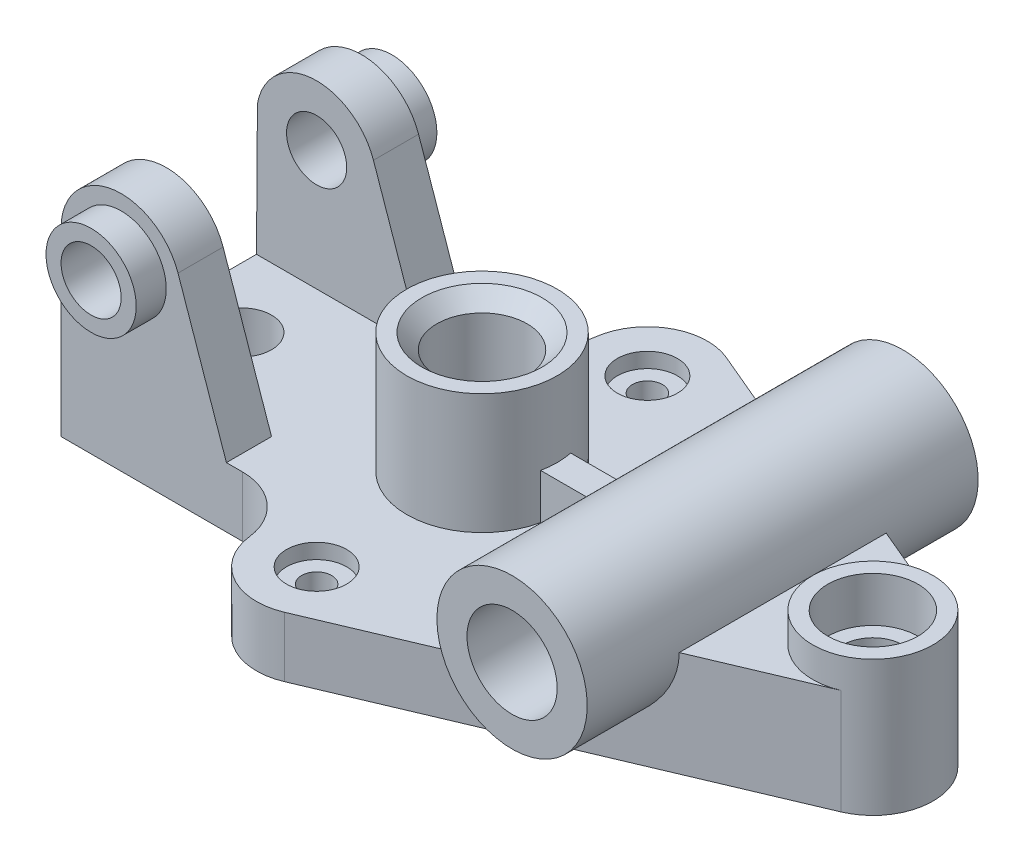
from build123d import *

# Parameters (mm, degrees)
SKETCH4_R                 = 10
BOSS_EXTRUDE1_DEPTH       = 20
SKETCH5_R                 = 10
BOSS_EXTRUDE2_DEPTH       = 15
BOSS_EXTRUDE4_START       = 10
SKETCH6_R                 = 15
SKETCH6_R_2               = 10
BOSS_EXTRUDE4_DEPTH       = 10
BOSS_EXTRUDE6_START       = -15
SKETCH10_R                = 10
BOSS_EXTRUDE6_DEPTH       = 15
SKETCH11_R                = 15
SKETCH11_R_2              = 10
BOSS_EXTRUDE7_DEPTH       = 10
BOSS_EXTRUDE8_DEPTH       = 40
BOSS_EXTRUDE8_DEPTH_BACK  = 35
SKETCH12_R                = 25
SKETCH19_R                = 20
BOSS_EXTRUDE9_DEPTH       = 25
BOSS_EXTRUDE10_DEPTH      = 15
BOSS_EXTRUDE14_DEPTH      = 65
BOSS_EXTRUDE14_DEPTH_BACK = 65
SKETCH28_R                = 25
SKETCH29_R                = 15
CUT_EXTRUDE2_DEPTH        = 181
RIB3_REACH                = 206.59
SKETCH31_WALL_W           = 436.18043746
SKETCH31_WALL_H           = 10
SKETCH34_R                = 5
CUT_EXTRUDE3_DEPTH        = 31
SKETCH35_R                = 10
CUT_EXTRUDE4_DEPTH        = 5


with BuildPart() as part:
    # Sketch4 → Boss-Extrude1 (new body)
    with BuildSketch(Plane(origin=(0, 0, 0), x_dir=(1, 0, 0), z_dir=(0, 1, 0))):
        with BuildLine():
            Line((-77.28011811, -56.673598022), (-77.28011811, 23.326401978))
            Line((-77.28011811, 23.326401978), (-16.966387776, 23.326401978))
            ThreePointArc((-16.966387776, 23.326401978), (-3.737631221, 28.326401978), (2.876747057, 40.826401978))
            ThreePointArc((2.876747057, 40.826401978), (12.736944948, 55.656750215), (30.512681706, 56.745747))
            Line((30.512681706, 56.745747), (160.512681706, 1.745747))
            ThreePointArc((160.512681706, 1.745747), (172.71988189, -16.673598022), (160.512681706, -35.092943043))
            Line((160.512681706, -35.092943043), (30.512681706, -90.092943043))
            ThreePointArc((30.512681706, -90.092943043), (12.736944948, -89.003946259), (2.876747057, -74.173598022))
            ThreePointArc((2.876747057, -74.173598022), (-3.737631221, -61.673598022), (-16.966387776, -56.673598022))
            Line((-16.966387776, -56.673598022), (-77.28011811, -56.673598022))
        make_face()
        with Locations(Location((-57.28011811, -16.673598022, 0), (0, 0, 270))):
            Circle(SKETCH4_R, mode=Mode.SUBTRACT)
    extrude(amount=BOSS_EXTRUDE1_DEPTH)

    # Sketch5 → Boss-Extrude2 (add)
    with BuildSketch(Plane.XY.offset(56.673598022)):
        with BuildLine():
            Line((-77.28011811, 20), (-77.28011811, 60))
            ThreePointArc((-77.28011811, 60), (-60.595178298, 79.723345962), (-38.379080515, 66.538407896))
            Line((-38.379080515, 66.538407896), (-22.28011811, 20))
            Line((-22.28011811, 20), (-77.28011811, 20))
        make_face()
        with Locations((-57.28011811, 60)):
            Circle(SKETCH5_R, mode=Mode.SUBTRACT)
    extrude(amount=-BOSS_EXTRUDE2_DEPTH)

    # Sketch6 → Boss-Extrude4 (add)
    with BuildSketch(Plane.XY.offset(56.673598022).offset(BOSS_EXTRUDE4_START)):
        with Locations(Location((-57.28011811, 60, 0), (0, 0, 180))):
            Circle(SKETCH6_R)
        with Locations((-57.28011811, 60)):
            Circle(SKETCH6_R_2, mode=Mode.SUBTRACT)
    extrude(amount=-BOSS_EXTRUDE4_DEPTH)

    # Sketch10 → Boss-Extrude6 (add)
    with BuildSketch(Plane(origin=(0, 0, -23.326401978), x_dir=(-1, 0, 0), z_dir=(0, 0, -1)).offset(BOSS_EXTRUDE6_START)):
        with BuildLine():
            Line((22.28011811, 20), (38.379080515, 66.538407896))
            ThreePointArc((38.379080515, 66.538407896), (58.842761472, 79.938860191), (76.96898439, 63.514049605))
            Line((76.96898439, 63.514049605), (77.28011811, 20))
            Line((77.28011811, 20), (22.28011811, 20))
        make_face()
        with Locations(Location((57.28011811, 60, 0), (0, 0, 180))):
            Circle(SKETCH10_R, mode=Mode.SUBTRACT)
    extrude(amount=BOSS_EXTRUDE6_DEPTH)

    # Sketch11 → Boss-Extrude7 (add)
    with BuildSketch(Plane(origin=(0, 0, -23.326401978), x_dir=(-1, 0, 0), z_dir=(0, 0, -1))):
        with Locations((57.28011811, 60)):
            Circle(SKETCH11_R)
        with Locations(Location((57.28011811, 60, 0), (0, 0, 180))):
            Circle(SKETCH11_R_2, mode=Mode.SUBTRACT)
    extrude(amount=BOSS_EXTRUDE7_DEPTH)

    # Sketch12 → Boss-Extrude8 (add, two sides: drawn at the far end of the back side and taken through both)
    with BuildSketch(Plane(origin=(0, 20, 0), x_dir=(1, 0, 0), z_dir=(0, 1, 0)).offset(-BOSS_EXTRUDE8_DEPTH_BACK)):
        with Locations(Location((22.71988189, -16.673598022, 0), (0, 0, 270))):
            Circle(SKETCH12_R)
    extrude(amount=BOSS_EXTRUDE8_DEPTH + BOSS_EXTRUDE8_DEPTH_BACK)

    # Sketch18 → CSK for M10 Countersunk Flat Head Screw1 (revolve, cut)
    with BuildSketch(Plane(origin=(22.71988189, 60, 16.673598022), x_dir=(0, 0, 1), z_dir=(1, 0, 0))):
        Polygon((0, 0), (0, 75), (20, 75), (15, 70), (15, 5), (20, 0), align=None)
    revolve(axis=Axis((22.71988189, 66.35, 16.673598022), (0, -1, 0)), mode=Mode.SUBTRACT)

    # Sketch19 → Boss-Extrude9 (add)
    with BuildSketch(Plane(origin=(0, 20, 0), x_dir=(1, 0, 0), z_dir=(0, 1, 0))):
        with Locations(Location((152.71988189, -16.673598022, 0), (0, 0, 67.067899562))):
            Circle(SKETCH19_R)
    extrude(amount=BOSS_EXTRUDE9_DEPTH)

    # Sketch20 → CBORE for M10 Hex Head Bolt3 (revolve, cut)
    with BuildSketch(Plane(origin=(152.71988189, 45, 16.673598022), x_dir=(0, 0, 1), z_dir=(1, 0, 0))):
        Polygon((0, 0), (0, 45), (20, 45), (10, 35), (10, 15), (15, 15), (15, 0), align=None)
    revolve(axis=Axis((152.71988189, 51.35, 16.673598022), (0, -1, 0)), mode=Mode.SUBTRACT)

    # Sketch23 → Boss-Extrude10 (add)
    with BuildSketch(Plane(origin=(0, 20, 0), x_dir=(1, 0, 0), z_dir=(0, 1, 0))):
        with BuildLine():
            ThreePointArc((160.512681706, -35.092943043), (132.71988189, -16.673598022), (160.512681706, 1.745747))
            Line((160.512681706, 1.745747), (72.71988189, 38.888854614))
            Line((72.71988189, 38.888854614), (72.71988189, -72.236050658))
            Line((72.71988189, -72.236050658), (160.512681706, -35.092943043))
        make_face()
    extrude(amount=BOSS_EXTRUDE10_DEPTH)

    # Sketch28 → Boss-Extrude14 (add, two sides: drawn at the far end of the back side and taken through both)
    with BuildSketch(Plane(origin=(0, 0, 16.673598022), x_dir=(-1, 0, 0), z_dir=(0, 0, -1)).offset(-BOSS_EXTRUDE14_DEPTH_BACK)):
        with Locations((-97.71988189, 35)):
            Circle(SKETCH28_R)
    extrude(amount=BOSS_EXTRUDE14_DEPTH + BOSS_EXTRUDE14_DEPTH_BACK)

    # Sketch29 → Cut-Extrude2 (cut)
    with BuildSketch(Plane(origin=(0, 0, -48.326401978), x_dir=(-1, 0, 0), z_dir=(0, 0, -1))):
        with Locations((-97.71988189, 35)):
            Circle(SKETCH29_R)
    extrude(amount=-CUT_EXTRUDE2_DEPTH, mode=Mode.SUBTRACT)

    # Sketch31 wall → Rib3 (add, up to next)
    with BuildSketch(Plane(origin=(60.21988189, 35, 16.673598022), x_dir=(-1, 0, 0), z_dir=(0, 1, 0)), mode=Mode.PRIVATE) as rib3_sk1:
        Rectangle(SKETCH31_WALL_W, SKETCH31_WALL_H)
    rib3_tool1 = extrude(rib3_sk1.sketch, amount=-RIB3_REACH, mode=Mode.PRIVATE) - part.part
    add(rib3_tool1.solids().sort_by_distance((60.21988189, 35, 16.673598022))[0])

    # Sketch34 → Cut-Extrude3 (cut)
    with BuildSketch(Plane(origin=(0, 20, 0), x_dir=(1, 0, 0), z_dir=(0, 1, 0))):
        with Locations(Location((22.71988189, 38.326401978, 0), (0, 0, 270))):
            Circle(SKETCH34_R)
    cut_extrude3 = extrude(amount=-CUT_EXTRUDE3_DEPTH, mode=Mode.SUBTRACT)

    # Sketch35 → Cut-Extrude4 (cut)
    with BuildSketch(Plane(origin=(0, 20, 0), x_dir=(1, 0, 0), z_dir=(0, 1, 0))):
        with Locations(Location((22.71988189, 38.326401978, 0), (0, 0, 270))):
            Circle(SKETCH35_R)
    cut_extrude4 = extrude(amount=-CUT_EXTRUDE4_DEPTH, mode=Mode.SUBTRACT)

    # Mirror3: Cut-Extrude3, Cut-Extrude4 across plane
    add(cut_extrude3.mirror(Plane(origin=(0, 0, 16.673598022), x_dir=(1, 0, 0), z_dir=(0, 0, -1))), mode=Mode.SUBTRACT)
    add(cut_extrude4.mirror(Plane(origin=(0, 0, 16.673598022), x_dir=(1, 0, 0), z_dir=(0, 0, -1))), mode=Mode.SUBTRACT)


solid = part.part
